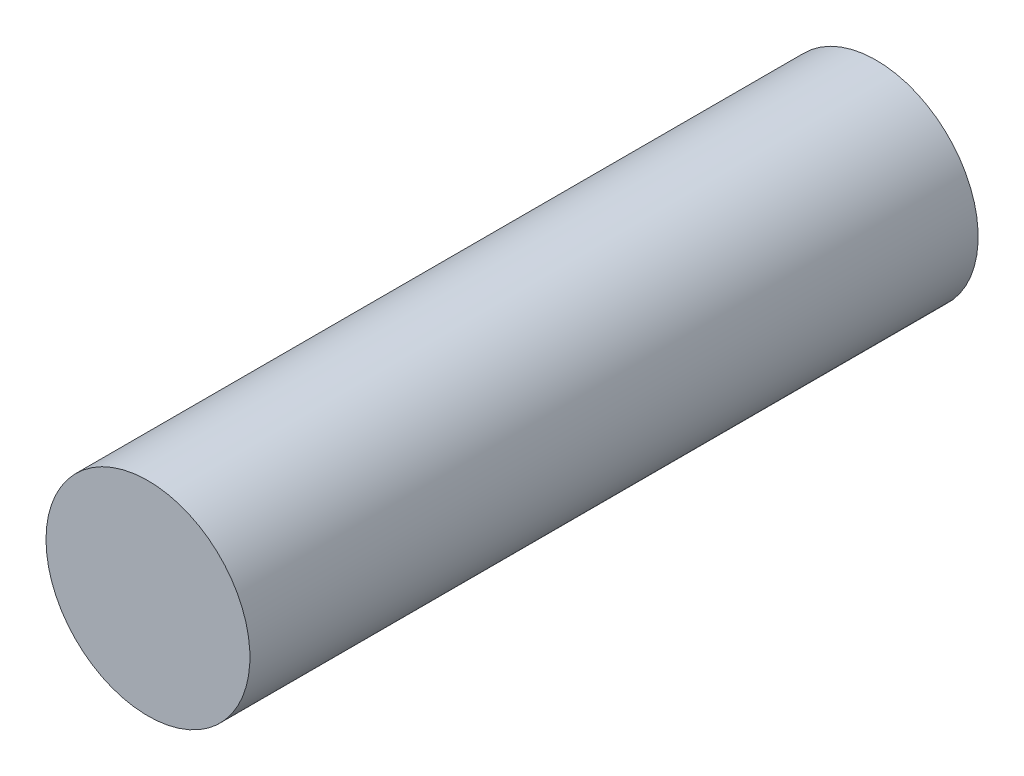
ISO-10303-21;
HEADER;
FILE_DESCRIPTION(('STEP AP214'),'2;1');
FILE_NAME('part.step','',(''),(''),'','','');
FILE_SCHEMA(('AUTOMOTIVE_DESIGN { 1 0 10303 214 1 1 1 1 }'));
ENDSEC;
DATA;
#1=APPLICATION_CONTEXT('core data for automotive mechanical design processes');
#2=APPLICATION_PROTOCOL_DEFINITION('international standard','automotive_design',2000,#1);
#3=PRODUCT_CONTEXT('',#1,'mechanical');
#4=PRODUCT('Part','Part','',(#3));
#5=PRODUCT_RELATED_PRODUCT_CATEGORY('part','',(#4));
#6=PRODUCT_DEFINITION_FORMATION('','',#4);
#7=PRODUCT_DEFINITION_CONTEXT('part definition',#1,'design');
#8=PRODUCT_DEFINITION('design','',#6,#7);
#9=PRODUCT_DEFINITION_SHAPE('','',#8);
#10=(LENGTH_UNIT() NAMED_UNIT(*) SI_UNIT(.MILLI.,.METRE.));
#11=(NAMED_UNIT(*) PLANE_ANGLE_UNIT() SI_UNIT($,.RADIAN.));
#12=(NAMED_UNIT(*) SI_UNIT($,.STERADIAN.) SOLID_ANGLE_UNIT());
#13=UNCERTAINTY_MEASURE_WITH_UNIT(LENGTH_MEASURE(1.E-05),#10,'distance_accuracy_value','');
#14=(GEOMETRIC_REPRESENTATION_CONTEXT(3) GLOBAL_UNCERTAINTY_ASSIGNED_CONTEXT((#13)) GLOBAL_UNIT_ASSIGNED_CONTEXT((#10,
#11,#12)) REPRESENTATION_CONTEXT('',''));
#15=CARTESIAN_POINT('',(0.,0.,0.));
#16=DIRECTION('',(0.,0.,1.));
#17=DIRECTION('',(1.,0.,0.));
#18=AXIS2_PLACEMENT_3D('',#15,#16,#17);
#19=CARTESIAN_POINT('',(0.,0.,76.2));
#20=DIRECTION('',(0.,0.,-1.));
#21=DIRECTION('',(-1.,0.,0.));
#22=AXIS2_PLACEMENT_3D('',#19,#20,#21);
#23=CYLINDRICAL_SURFACE('',#22,10.668);
#24=CARTESIAN_POINT('',(0.,0.,76.2));
#25=DIRECTION('',(0.,0.,1.));
#26=DIRECTION('',(1.,0.,0.));
#27=AXIS2_PLACEMENT_3D('',#24,#25,#26);
#28=CIRCLE('',#27,10.668);
#29=CARTESIAN_POINT('',(-10.668,0.,76.2));
#30=VERTEX_POINT('',#29);
#31=EDGE_CURVE('E10',#30,#30,#28,.T.);
#32=CARTESIAN_POINT('',(0.,0.,0.));
#33=DIRECTION('',(0.,0.,1.));
#34=DIRECTION('',(1.,0.,0.));
#35=AXIS2_PLACEMENT_3D('',#32,#33,#34);
#36=CIRCLE('',#35,10.668);
#37=CARTESIAN_POINT('',(-10.668,0.,0.));
#38=VERTEX_POINT('',#37);
#39=EDGE_CURVE('E33',#38,#38,#36,.T.);
#40=CARTESIAN_POINT('',(-10.668,0.,76.2));
#41=CARTESIAN_POINT('',(-10.668,0.,75.40625));
#42=CARTESIAN_POINT('',(-10.668,0.,74.6125));
#43=CARTESIAN_POINT('',(-10.668,0.,73.025));
#44=CARTESIAN_POINT('',(-10.668,0.,72.23125));
#45=CARTESIAN_POINT('',(-10.668,0.,70.64375));
#46=CARTESIAN_POINT('',(-10.668,0.,69.85));
#47=CARTESIAN_POINT('',(-10.668,0.,68.2625));
#48=CARTESIAN_POINT('',(-10.668,0.,67.46875));
#49=CARTESIAN_POINT('',(-10.668,0.,65.88125));
#50=CARTESIAN_POINT('',(-10.668,0.,65.0875));
#51=CARTESIAN_POINT('',(-10.668,0.,63.5));
#52=CARTESIAN_POINT('',(-10.668,0.,62.70625));
#53=CARTESIAN_POINT('',(-10.668,0.,61.11875));
#54=CARTESIAN_POINT('',(-10.668,0.,60.325));
#55=CARTESIAN_POINT('',(-10.668,0.,58.7375));
#56=CARTESIAN_POINT('',(-10.668,0.,57.94375));
#57=CARTESIAN_POINT('',(-10.668,0.,56.35625));
#58=CARTESIAN_POINT('',(-10.668,0.,55.5625));
#59=CARTESIAN_POINT('',(-10.668,0.,53.975));
#60=CARTESIAN_POINT('',(-10.668,0.,53.18125));
#61=CARTESIAN_POINT('',(-10.668,0.,51.59375));
#62=CARTESIAN_POINT('',(-10.668,0.,50.8));
#63=CARTESIAN_POINT('',(-10.668,0.,49.2125));
#64=CARTESIAN_POINT('',(-10.668,0.,48.41875));
#65=CARTESIAN_POINT('',(-10.668,0.,46.83125));
#66=CARTESIAN_POINT('',(-10.668,0.,46.0375));
#67=CARTESIAN_POINT('',(-10.668,0.,44.45));
#68=CARTESIAN_POINT('',(-10.668,0.,43.65625));
#69=CARTESIAN_POINT('',(-10.668,0.,42.06875));
#70=CARTESIAN_POINT('',(-10.668,0.,41.275));
#71=CARTESIAN_POINT('',(-10.668,0.,39.6875));
#72=CARTESIAN_POINT('',(-10.668,0.,38.89375));
#73=CARTESIAN_POINT('',(-10.668,0.,37.30625));
#74=CARTESIAN_POINT('',(-10.668,0.,36.5125));
#75=CARTESIAN_POINT('',(-10.668,0.,34.925));
#76=CARTESIAN_POINT('',(-10.668,0.,34.13125));
#77=CARTESIAN_POINT('',(-10.668,0.,32.54375));
#78=CARTESIAN_POINT('',(-10.668,0.,31.75));
#79=CARTESIAN_POINT('',(-10.668,0.,30.1625));
#80=CARTESIAN_POINT('',(-10.668,0.,29.36875));
#81=CARTESIAN_POINT('',(-10.668,0.,27.78125));
#82=CARTESIAN_POINT('',(-10.668,0.,26.9875));
#83=CARTESIAN_POINT('',(-10.668,0.,25.4));
#84=CARTESIAN_POINT('',(-10.668,0.,24.60625));
#85=CARTESIAN_POINT('',(-10.668,0.,23.01875));
#86=CARTESIAN_POINT('',(-10.668,0.,22.225));
#87=CARTESIAN_POINT('',(-10.668,0.,20.6375));
#88=CARTESIAN_POINT('',(-10.668,0.,19.84375));
#89=CARTESIAN_POINT('',(-10.668,0.,18.25625));
#90=CARTESIAN_POINT('',(-10.668,0.,17.4625));
#91=CARTESIAN_POINT('',(-10.668,0.,15.875));
#92=CARTESIAN_POINT('',(-10.668,0.,15.08125));
#93=CARTESIAN_POINT('',(-10.668,0.,13.49375));
#94=CARTESIAN_POINT('',(-10.668,0.,12.7));
#95=CARTESIAN_POINT('',(-10.668,0.,11.1125));
#96=CARTESIAN_POINT('',(-10.668,0.,10.31875));
#97=CARTESIAN_POINT('',(-10.668,0.,8.73125));
#98=CARTESIAN_POINT('',(-10.668,0.,7.93750000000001));
#99=CARTESIAN_POINT('',(-10.668,0.,6.35));
#100=CARTESIAN_POINT('',(-10.668,0.,5.55625));
#101=CARTESIAN_POINT('',(-10.668,0.,3.96875));
#102=CARTESIAN_POINT('',(-10.668,0.,3.175));
#103=CARTESIAN_POINT('',(-10.668,0.,1.5875));
#104=CARTESIAN_POINT('',(-10.668,0.,0.793750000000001));
#105=CARTESIAN_POINT('',(-10.668,0.,0.));
#106=B_SPLINE_CURVE_WITH_KNOTS('',3,(#40,#41,#42,#43,#44,#45,#46,#47,#48,#49,#50,#51,#52,#53,
#54,#55,#56,#57,#58,#59,#60,#61,#62,#63,#64,#65,#66,#67,#68,#69,#70,#71,#72,#73,#74,#75,#76,#77,
#78,#79,#80,#81,#82,#83,#84,#85,#86,#87,#88,#89,#90,#91,#92,#93,#94,#95,#96,#97,#98,#99,#100,
#101,#102,#103,#104,#105),.UNSPECIFIED.,.F.,.F.,(4,2,2,2,2,2,2,2,2,2,2,2,2,2,2,2,2,2,2,2,2,2,2,
2,2,2,2,2,2,2,2,2,4),(0.,2.38125,4.7625,7.14375,9.52500000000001,11.90625,14.2875,16.66875,
19.05,21.43125,23.8125,26.19375,28.575,30.95625,33.3375,35.71875,38.1,40.48125,42.8625,45.24375,
47.625,50.00625,52.3875,54.76875,57.15,59.53125,61.9125,64.29375,66.675,69.05625,71.4375,
73.81875,76.2),.UNSPECIFIED.);
#107=EDGE_CURVE('BSEAM30',#30,#38,#106,.T.);
#108=ORIENTED_EDGE('',*,*,#31,.F.);
#109=ORIENTED_EDGE('',*,*,#39,.T.);
#110=ORIENTED_EDGE('',*,*,#107,.T.);
#111=ORIENTED_EDGE('',*,*,#107,.F.);
#112=EDGE_LOOP('',(#108,#110,#109,#111));
#113=FACE_BOUND('',#112,.T.);
#114=ADVANCED_FACE('F30',(#113),#23,.T.);
#115=CARTESIAN_POINT('',(0.,0.,76.2));
#116=DIRECTION('',(0.,0.,1.));
#117=DIRECTION('',(1.,0.,0.));
#118=AXIS2_PLACEMENT_3D('',#115,#116,#117);
#119=PLANE('',#118);
#120=ORIENTED_EDGE('',*,*,#31,.T.);
#121=EDGE_LOOP('',(#120));
#122=FACE_BOUND('',#121,.T.);
#123=ADVANCED_FACE('F45',(#122),#119,.T.);
#124=CARTESIAN_POINT('',(0.,0.,0.));
#125=DIRECTION('',(0.,0.,1.));
#126=DIRECTION('',(1.,0.,0.));
#127=AXIS2_PLACEMENT_3D('',#124,#125,#126);
#128=PLANE('',#127);
#129=ORIENTED_EDGE('',*,*,#39,.F.);
#130=EDGE_LOOP('',(#129));
#131=FACE_BOUND('',#130,.T.);
#132=ADVANCED_FACE('F43',(#131),#128,.F.);
#133=CLOSED_SHELL('',(#114,#123,#132));
#134=MANIFOLD_SOLID_BREP('B2',#133);
#135=ADVANCED_BREP_SHAPE_REPRESENTATION('',(#18,#134),#14);
#136=SHAPE_DEFINITION_REPRESENTATION(#9,#135);
ENDSEC;
END-ISO-10303-21;
